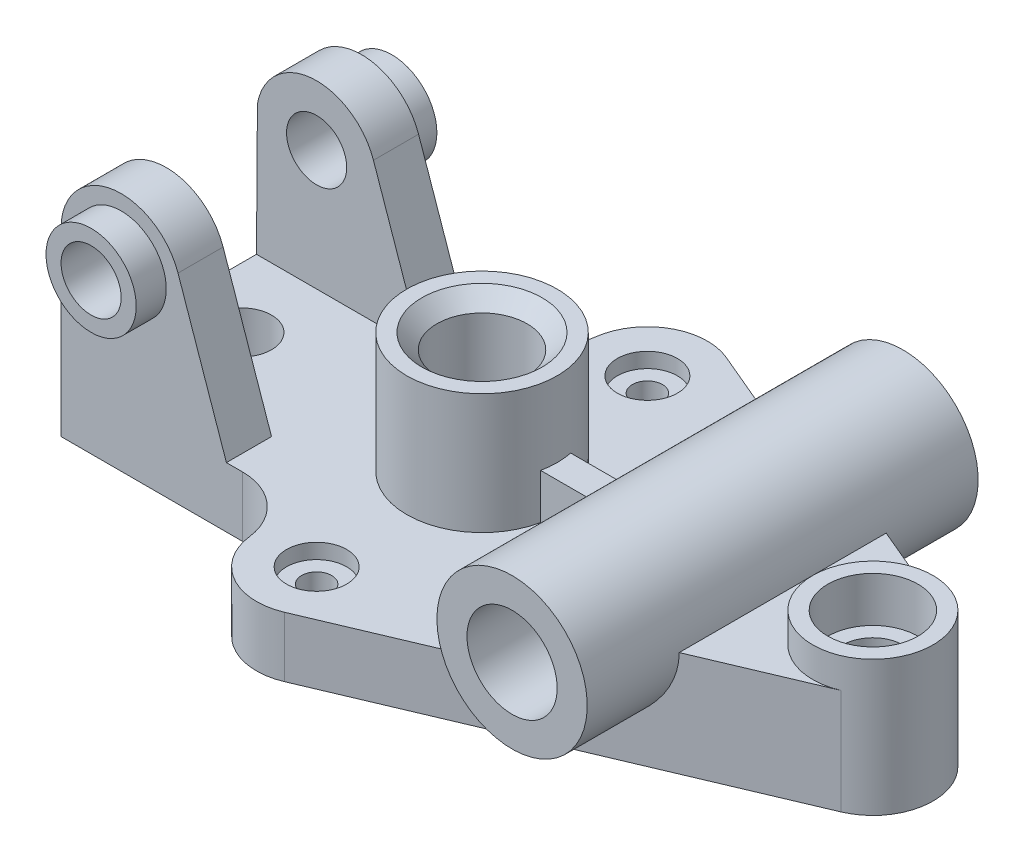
ISO-10303-21;
HEADER;
FILE_DESCRIPTION(('STEP AP214'),'2;1');
FILE_NAME('part.step','',(''),(''),'','','');
FILE_SCHEMA(('AUTOMOTIVE_DESIGN { 1 0 10303 214 1 1 1 1 }'));
ENDSEC;
DATA;
#1=APPLICATION_CONTEXT('core data for automotive mechanical design processes');
#2=APPLICATION_PROTOCOL_DEFINITION('international standard','automotive_design',2000,#1);
#3=PRODUCT_CONTEXT('',#1,'mechanical');
#4=PRODUCT('Part','Part','',(#3));
#5=PRODUCT_RELATED_PRODUCT_CATEGORY('part','',(#4));
#6=PRODUCT_DEFINITION_FORMATION('','',#4);
#7=PRODUCT_DEFINITION_CONTEXT('part definition',#1,'design');
#8=PRODUCT_DEFINITION('design','',#6,#7);
#9=PRODUCT_DEFINITION_SHAPE('','',#8);
#10=(LENGTH_UNIT() NAMED_UNIT(*) SI_UNIT(.MILLI.,.METRE.));
#11=(NAMED_UNIT(*) PLANE_ANGLE_UNIT() SI_UNIT($,.RADIAN.));
#12=(NAMED_UNIT(*) SI_UNIT($,.STERADIAN.) SOLID_ANGLE_UNIT());
#13=UNCERTAINTY_MEASURE_WITH_UNIT(LENGTH_MEASURE(1.E-05),#10,'distance_accuracy_value','');
#14=(GEOMETRIC_REPRESENTATION_CONTEXT(3) GLOBAL_UNCERTAINTY_ASSIGNED_CONTEXT((#13)) GLOBAL_UNIT_ASSIGNED_CONTEXT((#10,
#11,#12)) REPRESENTATION_CONTEXT('',''));
#15=CARTESIAN_POINT('',(0.,0.,0.));
#16=DIRECTION('',(0.,0.,1.));
#17=DIRECTION('',(1.,0.,0.));
#18=AXIS2_PLACEMENT_3D('',#15,#16,#17);
#19=CARTESIAN_POINT('',(22.7198818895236,-11.,71.6735980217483));
#20=DIRECTION('',(0.,1.,0.));
#21=DIRECTION('',(0.,0.,1.));
#22=AXIS2_PLACEMENT_3D('',#19,#20,#21);
#23=CYLINDRICAL_SURFACE('',#22,5.);
#24=CARTESIAN_POINT('',(22.7198818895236,0.,71.6735980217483));
#25=DIRECTION('',(0.,1.,0.));
#26=DIRECTION('',(0.,0.,1.));
#27=AXIS2_PLACEMENT_3D('',#24,#25,#26);
#28=CIRCLE('',#27,5.);
#29=CARTESIAN_POINT('',(22.7198818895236,0.,76.6735980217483));
#30=VERTEX_POINT('',#29);
#31=EDGE_CURVE('E581',#30,#30,#28,.F.);
#32=ORIENTED_EDGE('',*,*,#31,.T.);
#33=EDGE_LOOP('',(#32));
#34=FACE_BOUND('',#33,.T.);
#35=CARTESIAN_POINT('',(22.7198818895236,15.,71.6735980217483));
#36=DIRECTION('',(0.,1.,0.));
#37=DIRECTION('',(0.,0.,1.));
#38=AXIS2_PLACEMENT_3D('',#35,#36,#37);
#39=CIRCLE('',#38,5.);
#40=CARTESIAN_POINT('',(22.7198818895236,15.,76.6735980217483));
#41=VERTEX_POINT('',#40);
#42=EDGE_CURVE('E57',#41,#41,#39,.T.);
#43=ORIENTED_EDGE('',*,*,#42,.T.);
#44=EDGE_LOOP('',(#43));
#45=FACE_BOUND('',#44,.T.);
#46=ADVANCED_FACE('F53',(#34,#45),#23,.F.);
#47=CARTESIAN_POINT('',(22.7198818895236,-11.,-38.3264019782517));
#48=DIRECTION('',(0.,1.,0.));
#49=DIRECTION('',(0.,0.,1.));
#50=AXIS2_PLACEMENT_3D('',#47,#48,#49);
#51=CYLINDRICAL_SURFACE('',#50,5.);
#52=CARTESIAN_POINT('',(22.7198818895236,0.,-38.3264019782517));
#53=DIRECTION('',(0.,1.,0.));
#54=DIRECTION('',(0.,0.,1.));
#55=AXIS2_PLACEMENT_3D('',#52,#53,#54);
#56=CIRCLE('',#55,5.);
#57=CARTESIAN_POINT('',(22.7198818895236,0.,-33.3264019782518));
#58=VERTEX_POINT('',#57);
#59=EDGE_CURVE('E231',#58,#58,#56,.T.);
#60=ORIENTED_EDGE('',*,*,#59,.F.);
#61=EDGE_LOOP('',(#60));
#62=FACE_BOUND('',#61,.T.);
#63=CARTESIAN_POINT('',(22.7198818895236,15.,-38.3264019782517));
#64=DIRECTION('',(0.,1.,0.));
#65=DIRECTION('',(0.,0.,1.));
#66=AXIS2_PLACEMENT_3D('',#63,#64,#65);
#67=CIRCLE('',#66,5.);
#68=CARTESIAN_POINT('',(22.7198818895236,15.,-33.3264019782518));
#69=VERTEX_POINT('',#68);
#70=EDGE_CURVE('E577',#69,#69,#67,.F.);
#71=ORIENTED_EDGE('',*,*,#70,.F.);
#72=EDGE_LOOP('',(#71));
#73=FACE_BOUND('',#72,.T.);
#74=ADVANCED_FACE('F895',(#62,#73),#51,.F.);
#75=CARTESIAN_POINT('',(72.7198818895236,35.,0.));
#76=DIRECTION('',(1.,0.,0.));
#77=DIRECTION('',(0.,0.,-1.));
#78=AXIS2_PLACEMENT_3D('',#75,#76,#77);
#79=PLANE('',#78);
#80=DIRECTION('',(0.,1.,0.));
#81=VECTOR('',#80,1.);
#82=CARTESIAN_POINT('',(72.7198818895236,35.,21.6735980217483));
#83=LINE('',#82,#81);
#84=CARTESIAN_POINT('',(72.7198818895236,20.,21.6735980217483));
#85=VERTEX_POINT('',#84);
#86=CARTESIAN_POINT('',(72.7198818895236,35.,21.6735980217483));
#87=VERTEX_POINT('',#86);
#88=EDGE_CURVE('E228',#85,#87,#83,.T.);
#89=ORIENTED_EDGE('',*,*,#88,.F.);
#90=DIRECTION('',(0.,0.,1.));
#91=VECTOR('',#90,1.);
#92=CARTESIAN_POINT('',(72.7198818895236,20.,0.));
#93=LINE('',#92,#91);
#94=CARTESIAN_POINT('',(72.7198818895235,20.,72.2360506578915));
#95=VERTEX_POINT('',#94);
#96=EDGE_CURVE('E279',#85,#95,#93,.T.);
#97=ORIENTED_EDGE('',*,*,#96,.T.);
#98=DIRECTION('',(0.,-1.,0.));
#99=VECTOR('',#98,1.);
#100=CARTESIAN_POINT('',(72.7198818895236,35.,72.2360506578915));
#101=LINE('',#100,#99);
#102=CARTESIAN_POINT('',(72.7198818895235,35.,72.2360506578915));
#103=VERTEX_POINT('',#102);
#104=EDGE_CURVE('E295',#103,#95,#101,.T.);
#105=ORIENTED_EDGE('',*,*,#104,.F.);
#106=DIRECTION('',(0.,0.,1.));
#107=VECTOR('',#106,1.);
#108=CARTESIAN_POINT('',(72.7198818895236,35.,0.));
#109=LINE('',#108,#107);
#110=EDGE_CURVE('E283',#87,#103,#109,.T.);
#111=ORIENTED_EDGE('',*,*,#110,.F.);
#112=EDGE_LOOP('',(#89,#97,#105,#111));
#113=FACE_BOUND('',#112,.T.);
#114=ADVANCED_FACE('F867',(#113),#79,.F.);
#115=CARTESIAN_POINT('',(-16.9663877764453,20.,-43.3264019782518));
#116=DIRECTION('',(0.,1.,0.));
#117=DIRECTION('',(0.,0.,1.));
#118=AXIS2_PLACEMENT_3D('',#115,#116,#117);
#119=PLANE('',#118);
#120=CARTESIAN_POINT('',(22.7198818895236,20.,71.6735980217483));
#121=DIRECTION('',(0.,-1.,0.));
#122=DIRECTION('',(0.,0.,-1.));
#123=AXIS2_PLACEMENT_3D('',#120,#121,#122);
#124=CIRCLE('',#123,10.);
#125=CARTESIAN_POINT('',(22.7198818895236,20.,61.6735980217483));
#126=VERTEX_POINT('',#125);
#127=EDGE_CURVE('E599',#126,#126,#124,.T.);
#128=ORIENTED_EDGE('',*,*,#127,.T.);
#129=EDGE_LOOP('',(#128));
#130=FACE_BOUND('',#129,.T.);
#131=CARTESIAN_POINT('',(22.7198818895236,20.,-38.3264019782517));
#132=DIRECTION('',(0.,1.,0.));
#133=DIRECTION('',(0.,0.,1.));
#134=AXIS2_PLACEMENT_3D('',#131,#132,#133);
#135=CIRCLE('',#134,10.);
#136=CARTESIAN_POINT('',(22.7198818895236,20.,-28.3264019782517));
#137=VERTEX_POINT('',#136);
#138=EDGE_CURVE('E584',#137,#137,#135,.T.);
#139=ORIENTED_EDGE('',*,*,#138,.F.);
#140=EDGE_LOOP('',(#139));
#141=FACE_BOUND('',#140,.T.);
#142=CARTESIAN_POINT('',(-57.2801181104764,20.,16.6735980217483));
#143=DIRECTION('',(0.,1.,0.));
#144=DIRECTION('',(0.,0.,1.));
#145=AXIS2_PLACEMENT_3D('',#142,#143,#144);
#146=CIRCLE('',#145,10.);
#147=CARTESIAN_POINT('',(-57.2801181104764,20.,26.6735980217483));
#148=VERTEX_POINT('',#147);
#149=EDGE_CURVE('E455',#148,#148,#146,.T.);
#150=ORIENTED_EDGE('',*,*,#149,.F.);
#151=EDGE_LOOP('',(#150));
#152=FACE_BOUND('',#151,.T.);
#153=DIRECTION('',(-1.,0.,0.));
#154=VECTOR('',#153,1.);
#155=CARTESIAN_POINT('',(-16.9663877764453,20.,11.6735980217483));
#156=LINE('',#155,#154);
#157=CARTESIAN_POINT('',(72.7198818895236,20.,11.6735980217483));
#158=VERTEX_POINT('',#157);
#159=CARTESIAN_POINT('',(47.2147793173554,20.,11.6735980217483));
#160=VERTEX_POINT('',#159);
#161=EDGE_CURVE('E244',#158,#160,#156,.T.);
#162=ORIENTED_EDGE('',*,*,#161,.F.);
#163=CARTESIAN_POINT('',(72.7198818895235,20.,-38.888854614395));
#164=VERTEX_POINT('',#163);
#165=EDGE_CURVE('E284',#164,#158,#93,.T.);
#166=ORIENTED_EDGE('',*,*,#165,.F.);
#167=DIRECTION('',(-0.920967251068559,0.,-0.389639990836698));
#168=VECTOR('',#167,1.);
#169=CARTESIAN_POINT('',(30.5126817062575,20.,-56.7457469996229));
#170=LINE('',#169,#168);
#171=CARTESIAN_POINT('',(30.5126817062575,20.,-56.7457469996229));
#172=VERTEX_POINT('',#171);
#173=EDGE_CURVE('E485',#164,#172,#170,.T.);
#174=ORIENTED_EDGE('',*,*,#173,.T.);
#175=CARTESIAN_POINT('',(22.7198818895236,20.,-38.3264019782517));
#176=DIRECTION('',(0.,1.,0.));
#177=DIRECTION('',(0.,0.,-1.));
#178=AXIS2_PLACEMENT_3D('',#175,#176,#177);
#179=CIRCLE('',#178,20.);
#180=CARTESIAN_POINT('',(2.87674705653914,20.,-40.8264019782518));
#181=VERTEX_POINT('',#180);
#182=EDGE_CURVE('E488',#172,#181,#179,.T.);
#183=ORIENTED_EDGE('',*,*,#182,.T.);
#184=CARTESIAN_POINT('',(-16.9663877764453,20.,-43.3264019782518));
#185=DIRECTION('',(0.,-1.,0.));
#186=DIRECTION('',(0.,0.,1.));
#187=AXIS2_PLACEMENT_3D('',#184,#185,#186);
#188=CIRCLE('',#187,20.);
#189=CARTESIAN_POINT('',(-16.9663877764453,20.,-23.3264019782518));
#190=VERTEX_POINT('',#189);
#191=EDGE_CURVE('E491',#181,#190,#188,.T.);
#192=ORIENTED_EDGE('',*,*,#191,.T.);
#193=DIRECTION('',(-1.,0.,0.));
#194=VECTOR('',#193,1.);
#195=CARTESIAN_POINT('',(-77.2801181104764,20.,-23.3264019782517));
#196=LINE('',#195,#194);
#197=CARTESIAN_POINT('',(-22.2801181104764,20.,-23.3264019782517));
#198=VERTEX_POINT('',#197);
#199=EDGE_CURVE('E463',#190,#198,#196,.T.);
#200=ORIENTED_EDGE('',*,*,#199,.T.);
#201=DIRECTION('',(0.,0.,-1.));
#202=VECTOR('',#201,1.);
#203=CARTESIAN_POINT('',(-22.2801181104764,20.,-8.32640197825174));
#204=LINE('',#203,#202);
#205=CARTESIAN_POINT('',(-22.2801181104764,20.,-8.32640197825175));
#206=VERTEX_POINT('',#205);
#207=EDGE_CURVE('E398',#206,#198,#204,.T.);
#208=ORIENTED_EDGE('',*,*,#207,.F.);
#209=DIRECTION('',(-1.,0.,0.));
#210=VECTOR('',#209,1.);
#211=CARTESIAN_POINT('',(-77.2801181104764,20.,-8.32640197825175));
#212=LINE('',#211,#210);
#213=CARTESIAN_POINT('',(-77.2801181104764,20.,-8.32640197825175));
#214=VERTEX_POINT('',#213);
#215=EDGE_CURVE('E370',#206,#214,#212,.T.);
#216=ORIENTED_EDGE('',*,*,#215,.T.);
#217=DIRECTION('',(0.,0.,1.));
#218=VECTOR('',#217,1.);
#219=CARTESIAN_POINT('',(-77.2801181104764,20.,56.6735980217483));
#220=LINE('',#219,#218);
#221=CARTESIAN_POINT('',(-77.2801181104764,20.,41.6735980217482));
#222=VERTEX_POINT('',#221);
#223=EDGE_CURVE('E466',#214,#222,#220,.T.);
#224=ORIENTED_EDGE('',*,*,#223,.T.);
#225=DIRECTION('',(1.,0.,0.));
#226=VECTOR('',#225,1.);
#227=CARTESIAN_POINT('',(-77.2801181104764,20.,41.6735980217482));
#228=LINE('',#227,#226);
#229=CARTESIAN_POINT('',(-22.2801181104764,20.,41.6735980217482));
#230=VERTEX_POINT('',#229);
#231=EDGE_CURVE('E420',#222,#230,#228,.T.);
#232=ORIENTED_EDGE('',*,*,#231,.T.);
#233=DIRECTION('',(0.,0.,1.));
#234=VECTOR('',#233,1.);
#235=CARTESIAN_POINT('',(-22.2801181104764,20.,41.6735980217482));
#236=LINE('',#235,#234);
#237=CARTESIAN_POINT('',(-22.2801181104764,20.,56.6735980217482));
#238=VERTEX_POINT('',#237);
#239=EDGE_CURVE('E437',#230,#238,#236,.T.);
#240=ORIENTED_EDGE('',*,*,#239,.T.);
#241=DIRECTION('',(1.,0.,0.));
#242=VECTOR('',#241,1.);
#243=CARTESIAN_POINT('',(-77.2801181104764,20.,56.6735980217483));
#244=LINE('',#243,#242);
#245=CARTESIAN_POINT('',(-16.9663877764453,20.,56.6735980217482));
#246=VERTEX_POINT('',#245);
#247=EDGE_CURVE('E472',#238,#246,#244,.T.);
#248=ORIENTED_EDGE('',*,*,#247,.T.);
#249=CARTESIAN_POINT('',(-16.9663877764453,20.,76.6735980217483));
#250=DIRECTION('',(0.,-1.,0.));
#251=DIRECTION('',(0.,0.,-1.));
#252=AXIS2_PLACEMENT_3D('',#249,#250,#251);
#253=CIRCLE('',#252,20.);
#254=CARTESIAN_POINT('',(2.87674705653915,20.,74.1735980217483));
#255=VERTEX_POINT('',#254);
#256=EDGE_CURVE('E475',#246,#255,#253,.T.);
#257=ORIENTED_EDGE('',*,*,#256,.T.);
#258=CARTESIAN_POINT('',(22.7198818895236,20.,71.6735980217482));
#259=DIRECTION('',(0.,1.,0.));
#260=DIRECTION('',(0.,0.,1.));
#261=AXIS2_PLACEMENT_3D('',#258,#259,#260);
#262=CIRCLE('',#261,20.);
#263=CARTESIAN_POINT('',(30.5126817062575,20.,90.0929430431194));
#264=VERTEX_POINT('',#263);
#265=EDGE_CURVE('E478',#255,#264,#262,.T.);
#266=ORIENTED_EDGE('',*,*,#265,.T.);
#267=DIRECTION('',(0.920967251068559,0.,-0.389639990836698));
#268=VECTOR('',#267,1.);
#269=CARTESIAN_POINT('',(30.5126817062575,20.,90.0929430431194));
#270=LINE('',#269,#268);
#271=EDGE_CURVE('E481',#264,#95,#270,.T.);
#272=ORIENTED_EDGE('',*,*,#271,.T.);
#273=ORIENTED_EDGE('',*,*,#96,.F.);
#274=DIRECTION('',(-1.,0.,0.));
#275=VECTOR('',#274,1.);
#276=CARTESIAN_POINT('',(-16.9663877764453,20.,21.6735980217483));
#277=LINE('',#276,#275);
#278=CARTESIAN_POINT('',(47.2147793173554,20.,21.6735980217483));
#279=VERTEX_POINT('',#278);
#280=EDGE_CURVE('E238',#85,#279,#277,.T.);
#281=ORIENTED_EDGE('',*,*,#280,.T.);
#282=CARTESIAN_POINT('',(22.7198818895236,20.,16.6735980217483));
#283=DIRECTION('',(0.,1.,0.));
#284=DIRECTION('',(0.,0.,1.));
#285=AXIS2_PLACEMENT_3D('',#282,#283,#284);
#286=CIRCLE('',#285,25.);
#287=EDGE_CURVE('E63',#160,#279,#286,.T.);
#288=ORIENTED_EDGE('',*,*,#287,.F.);
#289=EDGE_LOOP('',(#162,#166,#174,#183,#192,#200,#208,#216,#224,#232,#240,#248,#257,#266,#272,
#273,#281,#288));
#290=FACE_BOUND('',#289,.T.);
#291=ADVANCED_FACE('F829',(#130,#141,#152,#290),#119,.T.);
#292=CARTESIAN_POINT('',(152.719881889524,20.,16.6735980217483));
#293=DIRECTION('',(0.,-1.,0.));
#294=DIRECTION('',(0.,0.,-1.));
#295=AXIS2_PLACEMENT_3D('',#292,#293,#294);
#296=CYLINDRICAL_SURFACE('',#295,20.);
#297=CARTESIAN_POINT('',(152.719881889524,0.,16.6735980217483));
#298=DIRECTION('',(0.,1.,0.));
#299=DIRECTION('',(0.,0.,1.));
#300=AXIS2_PLACEMENT_3D('',#297,#298,#299);
#301=CIRCLE('',#300,20.);
#302=CARTESIAN_POINT('',(160.512681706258,0.,35.0929430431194));
#303=VERTEX_POINT('',#302);
#304=CARTESIAN_POINT('',(160.512681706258,0.,-1.74574699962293));
#305=VERTEX_POINT('',#304);
#306=EDGE_CURVE('E514',#303,#305,#301,.T.);
#307=ORIENTED_EDGE('',*,*,#306,.T.);
#308=DIRECTION('',(0.,-1.,0.));
#309=VECTOR('',#308,1.);
#310=CARTESIAN_POINT('',(160.512681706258,20.,-1.74574699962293));
#311=LINE('',#310,#309);
#312=CARTESIAN_POINT('',(160.512681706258,35.,-1.74574699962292));
#313=VERTEX_POINT('',#312);
#314=EDGE_CURVE('E536',#313,#305,#311,.T.);
#315=ORIENTED_EDGE('',*,*,#314,.F.);
#316=CARTESIAN_POINT('',(152.719881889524,35.,16.6735980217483));
#317=DIRECTION('',(0.,1.,0.));
#318=DIRECTION('',(0.,0.,1.));
#319=AXIS2_PLACEMENT_3D('',#316,#317,#318);
#320=CIRCLE('',#319,20.);
#321=CARTESIAN_POINT('',(160.512681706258,35.,35.0929430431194));
#322=VERTEX_POINT('',#321);
#323=EDGE_CURVE('E292',#322,#313,#320,.F.);
#324=ORIENTED_EDGE('',*,*,#323,.F.);
#325=DIRECTION('',(0.,-1.,0.));
#326=VECTOR('',#325,1.);
#327=CARTESIAN_POINT('',(160.512681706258,20.,35.0929430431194));
#328=LINE('',#327,#326);
#329=EDGE_CURVE('E540',#322,#303,#328,.T.);
#330=ORIENTED_EDGE('',*,*,#329,.T.);
#331=EDGE_LOOP('',(#307,#315,#324,#330));
#332=FACE_BOUND('',#331,.T.);
#333=CARTESIAN_POINT('',(152.719881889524,45.,16.6735980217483));
#334=DIRECTION('',(0.,1.,0.));
#335=DIRECTION('',(0.,0.,1.));
#336=AXIS2_PLACEMENT_3D('',#333,#334,#335);
#337=CIRCLE('',#336,20.);
#338=CARTESIAN_POINT('',(152.719881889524,45.,36.6735980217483));
#339=VERTEX_POINT('',#338);
#340=EDGE_CURVE('E325',#339,#339,#337,.T.);
#341=ORIENTED_EDGE('',*,*,#340,.F.);
#342=EDGE_LOOP('',(#341));
#343=FACE_BOUND('',#342,.T.);
#344=ADVANCED_FACE('F921',(#332,#343),#296,.T.);
#345=CARTESIAN_POINT('',(-77.2801181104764,20.,56.6735980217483));
#346=DIRECTION('',(0.,0.,-1.));
#347=DIRECTION('',(-1.,0.,0.));
#348=AXIS2_PLACEMENT_3D('',#345,#346,#347);
#349=PLANE('',#348);
#350=DIRECTION('',(1.,0.,0.));
#351=VECTOR('',#350,1.);
#352=CARTESIAN_POINT('',(-77.2801181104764,0.,56.6735980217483));
#353=LINE('',#352,#351);
#354=CARTESIAN_POINT('',(-77.2801181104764,0.,56.6735980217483));
#355=VERTEX_POINT('',#354);
#356=CARTESIAN_POINT('',(-16.9663877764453,0.,56.6735980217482));
#357=VERTEX_POINT('',#356);
#358=EDGE_CURVE('E501',#355,#357,#353,.T.);
#359=ORIENTED_EDGE('',*,*,#358,.T.);
#360=DIRECTION('',(0.,-1.,0.));
#361=VECTOR('',#360,1.);
#362=CARTESIAN_POINT('',(-16.9663877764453,20.,56.6735980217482));
#363=LINE('',#362,#361);
#364=EDGE_CURVE('E552',#246,#357,#363,.T.);
#365=ORIENTED_EDGE('',*,*,#364,.F.);
#366=ORIENTED_EDGE('',*,*,#247,.F.);
#367=DIRECTION('',(-0.326920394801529,0.945051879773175,0.));
#368=VECTOR('',#367,1.);
#369=CARTESIAN_POINT('',(-38.3790805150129,66.5384078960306,56.6735980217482));
#370=LINE('',#369,#368);
#371=CARTESIAN_POINT('',(-38.3790805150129,66.5384078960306,56.6735980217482));
#372=VERTEX_POINT('',#371);
#373=EDGE_CURVE('E419',#238,#372,#370,.T.);
#374=ORIENTED_EDGE('',*,*,#373,.T.);
#375=CARTESIAN_POINT('',(-57.2801181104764,60.,56.6735980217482));
#376=DIRECTION('',(0.,0.,1.));
#377=DIRECTION('',(-1.,0.,0.));
#378=AXIS2_PLACEMENT_3D('',#375,#376,#377);
#379=CIRCLE('',#378,20.);
#380=CARTESIAN_POINT('',(-77.2801181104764,60.,56.6735980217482));
#381=VERTEX_POINT('',#380);
#382=EDGE_CURVE('E425',#372,#381,#379,.T.);
#383=ORIENTED_EDGE('',*,*,#382,.T.);
#384=DIRECTION('',(0.,-1.,0.));
#385=VECTOR('',#384,1.);
#386=CARTESIAN_POINT('',(-77.2801181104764,20.,56.6735980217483));
#387=LINE('',#386,#385);
#388=EDGE_CURVE('E556',#381,#355,#387,.T.);
#389=ORIENTED_EDGE('',*,*,#388,.T.);
#390=EDGE_LOOP('',(#359,#365,#366,#374,#383,#389));
#391=FACE_BOUND('',#390,.T.);
#392=CARTESIAN_POINT('',(-57.2801181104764,60.,56.6735980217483));
#393=DIRECTION('',(0.,0.,-1.));
#394=DIRECTION('',(-1.,0.,0.));
#395=AXIS2_PLACEMENT_3D('',#392,#393,#394);
#396=CIRCLE('',#395,15.);
#397=CARTESIAN_POINT('',(-72.2801181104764,60.,56.6735980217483));
#398=VERTEX_POINT('',#397);
#399=EDGE_CURVE('E564',#398,#398,#396,.F.);
#400=ORIENTED_EDGE('',*,*,#399,.F.);
#401=EDGE_LOOP('',(#400));
#402=FACE_BOUND('',#401,.T.);
#403=ADVANCED_FACE('F846',(#391,#402),#349,.F.);
#404=CARTESIAN_POINT('',(-16.9663877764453,0.,-43.3264019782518));
#405=DIRECTION('',(0.,1.,0.));
#406=DIRECTION('',(0.,0.,1.));
#407=AXIS2_PLACEMENT_3D('',#404,#405,#406);
#408=PLANE('',#407);
#409=ORIENTED_EDGE('',*,*,#31,.F.);
#410=EDGE_LOOP('',(#409));
#411=FACE_BOUND('',#410,.T.);
#412=ORIENTED_EDGE('',*,*,#59,.T.);
#413=EDGE_LOOP('',(#412));
#414=FACE_BOUND('',#413,.T.);
#415=CARTESIAN_POINT('',(22.7198818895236,0.,16.6735980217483));
#416=DIRECTION('',(0.,1.,0.));
#417=DIRECTION('',(0.,0.,1.));
#418=AXIS2_PLACEMENT_3D('',#415,#416,#417);
#419=CIRCLE('',#418,25.);
#420=CARTESIAN_POINT('',(22.7198818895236,0.,41.6735980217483));
#421=VERTEX_POINT('',#420);
#422=EDGE_CURVE('E353',#421,#421,#419,.T.);
#423=ORIENTED_EDGE('',*,*,#422,.T.);
#424=EDGE_LOOP('',(#423));
#425=FACE_BOUND('',#424,.T.);
#426=CARTESIAN_POINT('',(-57.2801181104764,0.,16.6735980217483));
#427=DIRECTION('',(0.,1.,0.));
#428=DIRECTION('',(0.,0.,1.));
#429=AXIS2_PLACEMENT_3D('',#426,#427,#428);
#430=CIRCLE('',#429,10.);
#431=CARTESIAN_POINT('',(-57.2801181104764,0.,26.6735980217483));
#432=VERTEX_POINT('',#431);
#433=EDGE_CURVE('E448',#432,#432,#430,.T.);
#434=ORIENTED_EDGE('',*,*,#433,.T.);
#435=EDGE_LOOP('',(#434));
#436=FACE_BOUND('',#435,.T.);
#437=CARTESIAN_POINT('',(152.719881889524,0.,16.6735980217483));
#438=DIRECTION('',(0.,1.,0.));
#439=DIRECTION('',(0.,0.,1.));
#440=AXIS2_PLACEMENT_3D('',#437,#438,#439);
#441=CIRCLE('',#440,20.);
#442=EDGE_CURVE('E306',#305,#303,#441,.T.);
#443=ORIENTED_EDGE('',*,*,#442,.T.);
#444=DIRECTION('',(0.920967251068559,0.,-0.389639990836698));
#445=VECTOR('',#444,1.);
#446=CARTESIAN_POINT('',(30.5126817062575,0.,90.0929430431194));
#447=LINE('',#446,#445);
#448=CARTESIAN_POINT('',(30.5126817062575,0.,90.0929430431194));
#449=VERTEX_POINT('',#448);
#450=EDGE_CURVE('E510',#449,#303,#447,.T.);
#451=ORIENTED_EDGE('',*,*,#450,.F.);
#452=CARTESIAN_POINT('',(22.7198818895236,0.,71.6735980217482));
#453=DIRECTION('',(0.,1.,0.));
#454=DIRECTION('',(0.,0.,1.));
#455=AXIS2_PLACEMENT_3D('',#452,#453,#454);
#456=CIRCLE('',#455,20.);
#457=CARTESIAN_POINT('',(2.87674705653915,0.,74.1735980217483));
#458=VERTEX_POINT('',#457);
#459=EDGE_CURVE('E507',#458,#449,#456,.T.);
#460=ORIENTED_EDGE('',*,*,#459,.F.);
#461=CARTESIAN_POINT('',(-16.9663877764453,0.,76.6735980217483));
#462=DIRECTION('',(0.,-1.,0.));
#463=DIRECTION('',(0.,0.,-1.));
#464=AXIS2_PLACEMENT_3D('',#461,#462,#463);
#465=CIRCLE('',#464,20.);
#466=EDGE_CURVE('E504',#357,#458,#465,.T.);
#467=ORIENTED_EDGE('',*,*,#466,.F.);
#468=ORIENTED_EDGE('',*,*,#358,.F.);
#469=DIRECTION('',(0.,0.,1.));
#470=VECTOR('',#469,1.);
#471=CARTESIAN_POINT('',(-77.2801181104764,0.,56.6735980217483));
#472=LINE('',#471,#470);
#473=CARTESIAN_POINT('',(-77.2801181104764,0.,-23.3264019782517));
#474=VERTEX_POINT('',#473);
#475=EDGE_CURVE('E498',#474,#355,#472,.T.);
#476=ORIENTED_EDGE('',*,*,#475,.F.);
#477=DIRECTION('',(-1.,0.,0.));
#478=VECTOR('',#477,1.);
#479=CARTESIAN_POINT('',(-77.2801181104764,0.,-23.3264019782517));
#480=LINE('',#479,#478);
#481=CARTESIAN_POINT('',(-16.9663877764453,0.,-23.3264019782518));
#482=VERTEX_POINT('',#481);
#483=EDGE_CURVE('E459',#482,#474,#480,.T.);
#484=ORIENTED_EDGE('',*,*,#483,.F.);
#485=CARTESIAN_POINT('',(-16.9663877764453,0.,-43.3264019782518));
#486=DIRECTION('',(0.,-1.,0.));
#487=DIRECTION('',(0.,0.,1.));
#488=AXIS2_PLACEMENT_3D('',#485,#486,#487);
#489=CIRCLE('',#488,20.);
#490=CARTESIAN_POINT('',(2.87674705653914,0.,-40.8264019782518));
#491=VERTEX_POINT('',#490);
#492=EDGE_CURVE('E467',#491,#482,#489,.T.);
#493=ORIENTED_EDGE('',*,*,#492,.F.);
#494=CARTESIAN_POINT('',(22.7198818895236,0.,-38.3264019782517));
#495=DIRECTION('',(0.,1.,0.));
#496=DIRECTION('',(0.,0.,-1.));
#497=AXIS2_PLACEMENT_3D('',#494,#495,#496);
#498=CIRCLE('',#497,20.);
#499=CARTESIAN_POINT('',(30.5126817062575,0.,-56.7457469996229));
#500=VERTEX_POINT('',#499);
#501=EDGE_CURVE('E520',#500,#491,#498,.T.);
#502=ORIENTED_EDGE('',*,*,#501,.F.);
#503=DIRECTION('',(-0.920967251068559,0.,-0.389639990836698));
#504=VECTOR('',#503,1.);
#505=CARTESIAN_POINT('',(30.5126817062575,0.,-56.7457469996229));
#506=LINE('',#505,#504);
#507=EDGE_CURVE('E517',#305,#500,#506,.T.);
#508=ORIENTED_EDGE('',*,*,#507,.F.);
#509=EDGE_LOOP('',(#443,#451,#460,#467,#468,#476,#484,#493,#502,#508));
#510=FACE_BOUND('',#509,.T.);
#511=ADVANCED_FACE('F942',(#411,#414,#425,#436,#510),#408,.F.);
#512=CARTESIAN_POINT('',(-77.2801181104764,20.,-23.3264019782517));
#513=DIRECTION('',(0.,0.,1.));
#514=DIRECTION('',(1.,0.,0.));
#515=AXIS2_PLACEMENT_3D('',#512,#513,#514);
#516=PLANE('',#515);
#517=CARTESIAN_POINT('',(-57.2801181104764,60.,-23.3264019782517));
#518=DIRECTION('',(0.,0.,1.));
#519=DIRECTION('',(1.,0.,0.));
#520=AXIS2_PLACEMENT_3D('',#517,#518,#519);
#521=CIRCLE('',#520,15.);
#522=CARTESIAN_POINT('',(-42.2801181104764,60.,-23.3264019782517));
#523=VERTEX_POINT('',#522);
#524=EDGE_CURVE('E356',#523,#523,#521,.F.);
#525=ORIENTED_EDGE('',*,*,#524,.F.);
#526=EDGE_LOOP('',(#525));
#527=FACE_BOUND('',#526,.T.);
#528=ORIENTED_EDGE('',*,*,#483,.T.);
#529=DIRECTION('',(0.,-1.,0.));
#530=VECTOR('',#529,1.);
#531=CARTESIAN_POINT('',(-77.2801181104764,20.,-23.3264019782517));
#532=LINE('',#531,#530);
#533=CARTESIAN_POINT('',(-77.2801181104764,20.,-23.3264019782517));
#534=VERTEX_POINT('',#533);
#535=EDGE_CURVE('E560',#534,#474,#532,.T.);
#536=ORIENTED_EDGE('',*,*,#535,.F.);
#537=DIRECTION('',(0.0071500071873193,0.999974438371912,0.));
#538=VECTOR('',#537,1.);
#539=CARTESIAN_POINT('',(-76.9689843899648,63.5140496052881,-23.3264019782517));
#540=LINE('',#539,#538);
#541=CARTESIAN_POINT('',(-76.9689843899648,63.5140496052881,-23.3264019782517));
#542=VERTEX_POINT('',#541);
#543=EDGE_CURVE('E369',#534,#542,#540,.T.);
#544=ORIENTED_EDGE('',*,*,#543,.T.);
#545=CARTESIAN_POINT('',(-57.2801181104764,60.,-23.3264019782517));
#546=DIRECTION('',(0.,0.,-1.));
#547=DIRECTION('',(1.,0.,0.));
#548=AXIS2_PLACEMENT_3D('',#545,#546,#547);
#549=CIRCLE('',#548,20.);
#550=CARTESIAN_POINT('',(-38.3790805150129,66.5384078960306,-23.3264019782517));
#551=VERTEX_POINT('',#550);
#552=EDGE_CURVE('E391',#542,#551,#549,.T.);
#553=ORIENTED_EDGE('',*,*,#552,.T.);
#554=DIRECTION('',(0.326920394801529,-0.945051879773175,0.));
#555=VECTOR('',#554,1.);
#556=CARTESIAN_POINT('',(-22.2801181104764,20.,-23.3264019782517));
#557=LINE('',#556,#555);
#558=EDGE_CURVE('E375',#551,#198,#557,.T.);
#559=ORIENTED_EDGE('',*,*,#558,.T.);
#560=ORIENTED_EDGE('',*,*,#199,.F.);
#561=DIRECTION('',(0.,-1.,0.));
#562=VECTOR('',#561,1.);
#563=CARTESIAN_POINT('',(-16.9663877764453,20.,-23.3264019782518));
#564=LINE('',#563,#562);
#565=EDGE_CURVE('E494',#190,#482,#564,.T.);
#566=ORIENTED_EDGE('',*,*,#565,.T.);
#567=EDGE_LOOP('',(#528,#536,#544,#553,#559,#560,#566));
#568=FACE_BOUND('',#567,.T.);
#569=ADVANCED_FACE('F55',(#527,#568),#516,.F.);
#570=CARTESIAN_POINT('',(-77.2801181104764,20.,56.6735980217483));
#571=DIRECTION('',(1.,0.,0.));
#572=DIRECTION('',(0.,0.,-1.));
#573=AXIS2_PLACEMENT_3D('',#570,#571,#572);
#574=PLANE('',#573);
#575=ORIENTED_EDGE('',*,*,#475,.T.);
#576=ORIENTED_EDGE('',*,*,#388,.F.);
#577=DIRECTION('',(0.,0.,1.));
#578=VECTOR('',#577,1.);
#579=CARTESIAN_POINT('',(-77.2801181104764,60.,41.6735980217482));
#580=LINE('',#579,#578);
#581=CARTESIAN_POINT('',(-77.2801181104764,60.,41.6735980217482));
#582=VERTEX_POINT('',#581);
#583=EDGE_CURVE('E444',#582,#381,#580,.T.);
#584=ORIENTED_EDGE('',*,*,#583,.F.);
#585=DIRECTION('',(0.,-1.,0.));
#586=VECTOR('',#585,1.);
#587=CARTESIAN_POINT('',(-77.2801181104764,20.,41.6735980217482));
#588=LINE('',#587,#586);
#589=EDGE_CURVE('E433',#582,#222,#588,.T.);
#590=ORIENTED_EDGE('',*,*,#589,.T.);
#591=ORIENTED_EDGE('',*,*,#223,.F.);
#592=EDGE_CURVE('E468',#534,#214,#220,.T.);
#593=ORIENTED_EDGE('',*,*,#592,.F.);
#594=ORIENTED_EDGE('',*,*,#535,.T.);
#595=EDGE_LOOP('',(#575,#576,#584,#590,#591,#593,#594));
#596=FACE_BOUND('',#595,.T.);
#597=ADVANCED_FACE('F837',(#596),#574,.F.);
#598=CARTESIAN_POINT('',(-16.9663877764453,20.,76.6735980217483));
#599=DIRECTION('',(0.,-1.,0.));
#600=DIRECTION('',(0.,0.,-1.));
#601=AXIS2_PLACEMENT_3D('',#598,#599,#600);
#602=CYLINDRICAL_SURFACE('',#601,20.);
#603=ORIENTED_EDGE('',*,*,#466,.T.);
#604=DIRECTION('',(0.,-1.,0.));
#605=VECTOR('',#604,1.);
#606=CARTESIAN_POINT('',(2.87674705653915,20.,74.1735980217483));
#607=LINE('',#606,#605);
#608=EDGE_CURVE('E548',#255,#458,#607,.T.);
#609=ORIENTED_EDGE('',*,*,#608,.F.);
#610=ORIENTED_EDGE('',*,*,#256,.F.);
#611=ORIENTED_EDGE('',*,*,#364,.T.);
#612=EDGE_LOOP('',(#603,#609,#610,#611));
#613=FACE_BOUND('',#612,.T.);
#614=ADVANCED_FACE('F853',(#613),#602,.F.);
#615=CARTESIAN_POINT('',(22.7198818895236,20.,71.6735980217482));
#616=DIRECTION('',(0.,-1.,0.));
#617=DIRECTION('',(0.,0.,-1.));
#618=AXIS2_PLACEMENT_3D('',#615,#616,#617);
#619=CYLINDRICAL_SURFACE('',#618,20.);
#620=ORIENTED_EDGE('',*,*,#459,.T.);
#621=DIRECTION('',(0.,-1.,0.));
#622=VECTOR('',#621,1.);
#623=CARTESIAN_POINT('',(30.5126817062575,20.,90.0929430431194));
#624=LINE('',#623,#622);
#625=EDGE_CURVE('E544',#264,#449,#624,.T.);
#626=ORIENTED_EDGE('',*,*,#625,.F.);
#627=ORIENTED_EDGE('',*,*,#265,.F.);
#628=ORIENTED_EDGE('',*,*,#608,.T.);
#629=EDGE_LOOP('',(#620,#626,#627,#628));
#630=FACE_BOUND('',#629,.T.);
#631=ADVANCED_FACE('F859',(#630),#619,.T.);
#632=CARTESIAN_POINT('',(30.5126817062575,20.,90.0929430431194));
#633=DIRECTION('',(-0.389639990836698,0.,-0.920967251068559));
#634=DIRECTION('',(-0.920967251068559,0.,0.389639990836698));
#635=AXIS2_PLACEMENT_3D('',#632,#633,#634);
#636=PLANE('',#635);
#637=DIRECTION('',(0.920967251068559,0.,-0.389639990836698));
#638=VECTOR('',#637,1.);
#639=CARTESIAN_POINT('',(36.9618772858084,35.,87.3644372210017));
#640=LINE('',#639,#638);
#641=CARTESIAN_POINT('',(122.719881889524,35.,51.0822045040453));
#642=VERTEX_POINT('',#641);
#643=EDGE_CURVE('E289',#642,#322,#640,.T.);
#644=ORIENTED_EDGE('',*,*,#643,.F.);
#645=CARTESIAN_POINT('',(97.7198818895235,35.,61.6591275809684));
#646=DIRECTION('',(-0.389639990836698,0.,-0.920967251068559));
#647=DIRECTION('',(0.920967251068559,0.,-0.389639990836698));
#648=AXIS2_PLACEMENT_3D('',#645,#646,#647);
#649=ELLIPSE('',#648,27.1453734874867,25.);
#650=EDGE_CURVE('E275',#642,#103,#649,.T.);
#651=ORIENTED_EDGE('',*,*,#650,.T.);
#652=ORIENTED_EDGE('',*,*,#104,.T.);
#653=ORIENTED_EDGE('',*,*,#271,.F.);
#654=ORIENTED_EDGE('',*,*,#625,.T.);
#655=ORIENTED_EDGE('',*,*,#450,.T.);
#656=ORIENTED_EDGE('',*,*,#329,.F.);
#657=EDGE_LOOP('',(#644,#651,#652,#653,#654,#655,#656));
#658=FACE_BOUND('',#657,.T.);
#659=ADVANCED_FACE('F863',(#658),#636,.F.);
#660=CARTESIAN_POINT('',(30.5126817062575,20.,-56.7457469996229));
#661=DIRECTION('',(-0.389639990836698,0.,0.920967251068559));
#662=DIRECTION('',(0.920967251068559,0.,0.389639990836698));
#663=AXIS2_PLACEMENT_3D('',#660,#661,#662);
#664=PLANE('',#663);
#665=DIRECTION('',(0.,-1.,0.));
#666=VECTOR('',#665,1.);
#667=CARTESIAN_POINT('',(72.7198818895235,35.,-38.888854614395));
#668=LINE('',#667,#666);
#669=CARTESIAN_POINT('',(72.7198818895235,35.,-38.888854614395));
#670=VERTEX_POINT('',#669);
#671=EDGE_CURVE('E302',#670,#164,#668,.T.);
#672=ORIENTED_EDGE('',*,*,#671,.F.);
#673=CARTESIAN_POINT('',(97.7198818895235,35.,-28.3119315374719));
#674=DIRECTION('',(-0.389639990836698,0.,0.920967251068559));
#675=DIRECTION('',(-0.920967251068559,0.,-0.389639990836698));
#676=AXIS2_PLACEMENT_3D('',#673,#674,#675);
#677=ELLIPSE('',#676,27.1453734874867,25.);
#678=CARTESIAN_POINT('',(122.719881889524,35.,-17.7350084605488));
#679=VERTEX_POINT('',#678);
#680=EDGE_CURVE('E271',#670,#679,#677,.T.);
#681=ORIENTED_EDGE('',*,*,#680,.T.);
#682=DIRECTION('',(-0.920967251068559,0.,-0.389639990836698));
#683=VECTOR('',#682,1.);
#684=CARTESIAN_POINT('',(24.9953803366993,35.,-59.0799898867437));
#685=LINE('',#684,#683);
#686=EDGE_CURVE('E280',#313,#679,#685,.T.);
#687=ORIENTED_EDGE('',*,*,#686,.F.);
#688=ORIENTED_EDGE('',*,*,#314,.T.);
#689=ORIENTED_EDGE('',*,*,#507,.T.);
#690=DIRECTION('',(0.,-1.,0.));
#691=VECTOR('',#690,1.);
#692=CARTESIAN_POINT('',(30.5126817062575,20.,-56.7457469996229));
#693=LINE('',#692,#691);
#694=EDGE_CURVE('E532',#172,#500,#693,.T.);
#695=ORIENTED_EDGE('',*,*,#694,.F.);
#696=ORIENTED_EDGE('',*,*,#173,.F.);
#697=EDGE_LOOP('',(#672,#681,#687,#688,#689,#695,#696));
#698=FACE_BOUND('',#697,.T.);
#699=ADVANCED_FACE('F876',(#698),#664,.F.);
#700=CARTESIAN_POINT('',(22.7198818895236,20.,-38.3264019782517));
#701=DIRECTION('',(0.,-1.,0.));
#702=DIRECTION('',(0.,0.,-1.));
#703=AXIS2_PLACEMENT_3D('',#700,#701,#702);
#704=CYLINDRICAL_SURFACE('',#703,20.);
#705=ORIENTED_EDGE('',*,*,#501,.T.);
#706=DIRECTION('',(0.,-1.,0.));
#707=VECTOR('',#706,1.);
#708=CARTESIAN_POINT('',(2.87674705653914,20.,-40.8264019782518));
#709=LINE('',#708,#707);
#710=EDGE_CURVE('E528',#181,#491,#709,.T.);
#711=ORIENTED_EDGE('',*,*,#710,.F.);
#712=ORIENTED_EDGE('',*,*,#182,.F.);
#713=ORIENTED_EDGE('',*,*,#694,.T.);
#714=EDGE_LOOP('',(#705,#711,#712,#713));
#715=FACE_BOUND('',#714,.T.);
#716=ADVANCED_FACE('F936',(#715),#704,.T.);
#717=CARTESIAN_POINT('',(-16.9663877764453,20.,-43.3264019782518));
#718=DIRECTION('',(0.,-1.,0.));
#719=DIRECTION('',(0.,0.,-1.));
#720=AXIS2_PLACEMENT_3D('',#717,#718,#719);
#721=CYLINDRICAL_SURFACE('',#720,20.);
#722=ORIENTED_EDGE('',*,*,#492,.T.);
#723=ORIENTED_EDGE('',*,*,#565,.F.);
#724=ORIENTED_EDGE('',*,*,#191,.F.);
#725=ORIENTED_EDGE('',*,*,#710,.T.);
#726=EDGE_LOOP('',(#722,#723,#724,#725));
#727=FACE_BOUND('',#726,.T.);
#728=ADVANCED_FACE('F928',(#727),#721,.F.);
#729=CARTESIAN_POINT('',(-57.2801181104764,20.,16.6735980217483));
#730=DIRECTION('',(0.,-1.,0.));
#731=DIRECTION('',(0.,0.,-1.));
#732=AXIS2_PLACEMENT_3D('',#729,#730,#731);
#733=CYLINDRICAL_SURFACE('',#732,10.);
#734=ORIENTED_EDGE('',*,*,#433,.F.);
#735=EDGE_LOOP('',(#734));
#736=FACE_BOUND('',#735,.T.);
#737=ORIENTED_EDGE('',*,*,#149,.T.);
#738=EDGE_LOOP('',(#737));
#739=FACE_BOUND('',#738,.T.);
#740=ADVANCED_FACE('F926',(#736,#739),#733,.F.);
#741=CARTESIAN_POINT('',(-57.2801181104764,60.,41.6735980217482));
#742=DIRECTION('',(0.,0.,1.));
#743=DIRECTION('',(1.,0.,0.));
#744=AXIS2_PLACEMENT_3D('',#741,#742,#743);
#745=CYLINDRICAL_SURFACE('',#744,20.);
#746=ORIENTED_EDGE('',*,*,#382,.F.);
#747=DIRECTION('',(0.,0.,1.));
#748=VECTOR('',#747,1.);
#749=CARTESIAN_POINT('',(-38.3790805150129,66.5384078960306,41.6735980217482));
#750=LINE('',#749,#748);
#751=CARTESIAN_POINT('',(-38.3790805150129,66.5384078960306,41.6735980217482));
#752=VERTEX_POINT('',#751);
#753=EDGE_CURVE('E449',#752,#372,#750,.T.);
#754=ORIENTED_EDGE('',*,*,#753,.F.);
#755=CARTESIAN_POINT('',(-57.2801181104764,60.,41.6735980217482));
#756=DIRECTION('',(0.,0.,1.));
#757=DIRECTION('',(-1.,0.,0.));
#758=AXIS2_PLACEMENT_3D('',#755,#756,#757);
#759=CIRCLE('',#758,20.);
#760=EDGE_CURVE('E429',#752,#582,#759,.T.);
#761=ORIENTED_EDGE('',*,*,#760,.T.);
#762=ORIENTED_EDGE('',*,*,#583,.T.);
#763=EDGE_LOOP('',(#746,#754,#761,#762));
#764=FACE_BOUND('',#763,.T.);
#765=ADVANCED_FACE('F840',(#764),#745,.T.);
#766=CARTESIAN_POINT('',(-38.3790805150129,66.5384078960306,41.6735980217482));
#767=DIRECTION('',(0.945051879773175,0.326920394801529,0.));
#768=DIRECTION('',(-0.326920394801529,0.945051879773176,0.));
#769=AXIS2_PLACEMENT_3D('',#766,#767,#768);
#770=PLANE('',#769);
#771=ORIENTED_EDGE('',*,*,#373,.F.);
#772=ORIENTED_EDGE('',*,*,#239,.F.);
#773=DIRECTION('',(-0.326920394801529,0.945051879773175,0.));
#774=VECTOR('',#773,1.);
#775=CARTESIAN_POINT('',(-38.3790805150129,66.5384078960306,41.6735980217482));
#776=LINE('',#775,#774);
#777=EDGE_CURVE('E424',#230,#752,#776,.T.);
#778=ORIENTED_EDGE('',*,*,#777,.T.);
#779=ORIENTED_EDGE('',*,*,#753,.T.);
#780=EDGE_LOOP('',(#771,#772,#778,#779));
#781=FACE_BOUND('',#780,.T.);
#782=ADVANCED_FACE('F842',(#781),#770,.T.);
#783=CARTESIAN_POINT('',(-57.2801181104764,60.,41.6735980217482));
#784=DIRECTION('',(0.,0.,-1.));
#785=DIRECTION('',(-1.,0.,0.));
#786=AXIS2_PLACEMENT_3D('',#783,#784,#785);
#787=PLANE('',#786);
#788=CARTESIAN_POINT('',(-57.2801181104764,60.,41.6735980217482));
#789=DIRECTION('',(0.,0.,1.));
#790=DIRECTION('',(1.,0.,0.));
#791=AXIS2_PLACEMENT_3D('',#788,#789,#790);
#792=CIRCLE('',#791,10.);
#793=CARTESIAN_POINT('',(-47.2801181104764,60.,41.6735980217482));
#794=VERTEX_POINT('',#793);
#795=EDGE_CURVE('E415',#794,#794,#792,.T.);
#796=ORIENTED_EDGE('',*,*,#795,.T.);
#797=EDGE_LOOP('',(#796));
#798=FACE_BOUND('',#797,.T.);
#799=ORIENTED_EDGE('',*,*,#231,.F.);
#800=ORIENTED_EDGE('',*,*,#589,.F.);
#801=ORIENTED_EDGE('',*,*,#760,.F.);
#802=ORIENTED_EDGE('',*,*,#777,.F.);
#803=EDGE_LOOP('',(#799,#800,#801,#802));
#804=FACE_BOUND('',#803,.T.);
#805=ADVANCED_FACE('F835',(#798,#804),#787,.T.);
#806=CARTESIAN_POINT('',(-57.2801181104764,60.,41.6735980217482));
#807=DIRECTION('',(0.,0.,1.));
#808=DIRECTION('',(1.,0.,0.));
#809=AXIS2_PLACEMENT_3D('',#806,#807,#808);
#810=CYLINDRICAL_SURFACE('',#809,10.);
#811=ORIENTED_EDGE('',*,*,#795,.F.);
#812=EDGE_LOOP('',(#811));
#813=FACE_BOUND('',#812,.T.);
#814=CARTESIAN_POINT('',(-57.2801181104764,60.,66.6735980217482));
#815=DIRECTION('',(0.,0.,1.));
#816=DIRECTION('',(1.,0.,0.));
#817=AXIS2_PLACEMENT_3D('',#814,#815,#816);
#818=CIRCLE('',#817,10.);
#819=CARTESIAN_POINT('',(-47.2801181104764,60.,66.6735980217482));
#820=VERTEX_POINT('',#819);
#821=EDGE_CURVE('E402',#820,#820,#818,.F.);
#822=ORIENTED_EDGE('',*,*,#821,.F.);
#823=EDGE_LOOP('',(#822));
#824=FACE_BOUND('',#823,.T.);
#825=ADVANCED_FACE('F1070',(#813,#824),#810,.F.);
#826=CARTESIAN_POINT('',(-57.2801181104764,60.,66.6735980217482));
#827=DIRECTION('',(0.,0.,-1.));
#828=DIRECTION('',(-1.,0.,0.));
#829=AXIS2_PLACEMENT_3D('',#826,#827,#828);
#830=CYLINDRICAL_SURFACE('',#829,15.);
#831=CARTESIAN_POINT('',(-57.2801181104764,60.,66.6735980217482));
#832=DIRECTION('',(0.,0.,1.));
#833=DIRECTION('',(1.,0.,0.));
#834=AXIS2_PLACEMENT_3D('',#831,#832,#833);
#835=CIRCLE('',#834,15.);
#836=CARTESIAN_POINT('',(-42.2801181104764,60.,66.6735980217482));
#837=VERTEX_POINT('',#836);
#838=EDGE_CURVE('E411',#837,#837,#835,.T.);
#839=ORIENTED_EDGE('',*,*,#838,.F.);
#840=EDGE_LOOP('',(#839));
#841=FACE_BOUND('',#840,.T.);
#842=ORIENTED_EDGE('',*,*,#399,.T.);
#843=EDGE_LOOP('',(#842));
#844=FACE_BOUND('',#843,.T.);
#845=ADVANCED_FACE('F1066',(#841,#844),#830,.T.);
#846=CARTESIAN_POINT('',(-57.2801181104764,60.,66.6735980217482));
#847=DIRECTION('',(0.,0.,1.));
#848=DIRECTION('',(1.,0.,0.));
#849=AXIS2_PLACEMENT_3D('',#846,#847,#848);
#850=PLANE('',#849);
#851=ORIENTED_EDGE('',*,*,#821,.T.);
#852=EDGE_LOOP('',(#851));
#853=FACE_BOUND('',#852,.T.);
#854=ORIENTED_EDGE('',*,*,#838,.T.);
#855=EDGE_LOOP('',(#854));
#856=FACE_BOUND('',#855,.T.);
#857=ADVANCED_FACE('F1059',(#853,#856),#850,.T.);
#858=CARTESIAN_POINT('',(-22.2801181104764,20.,-8.32640197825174));
#859=DIRECTION('',(0.945051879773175,0.326920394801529,0.));
#860=DIRECTION('',(-0.326920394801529,0.945051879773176,0.));
#861=AXIS2_PLACEMENT_3D('',#858,#859,#860);
#862=PLANE('',#861);
#863=ORIENTED_EDGE('',*,*,#558,.F.);
#864=DIRECTION('',(0.,0.,-1.));
#865=VECTOR('',#864,1.);
#866=CARTESIAN_POINT('',(-38.3790805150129,66.5384078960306,-8.32640197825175));
#867=LINE('',#866,#865);
#868=CARTESIAN_POINT('',(-38.3790805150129,66.5384078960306,-8.32640197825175));
#869=VERTEX_POINT('',#868);
#870=EDGE_CURVE('E403',#869,#551,#867,.T.);
#871=ORIENTED_EDGE('',*,*,#870,.F.);
#872=DIRECTION('',(0.326920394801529,-0.945051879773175,0.));
#873=VECTOR('',#872,1.);
#874=CARTESIAN_POINT('',(-22.2801181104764,20.,-8.32640197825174));
#875=LINE('',#874,#873);
#876=EDGE_CURVE('E383',#869,#206,#875,.T.);
#877=ORIENTED_EDGE('',*,*,#876,.T.);
#878=ORIENTED_EDGE('',*,*,#207,.T.);
#879=EDGE_LOOP('',(#863,#871,#877,#878));
#880=FACE_BOUND('',#879,.T.);
#881=ADVANCED_FACE('F990',(#880),#862,.T.);
#882=CARTESIAN_POINT('',(-57.2801181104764,60.,-8.32640197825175));
#883=DIRECTION('',(0.,0.,-1.));
#884=DIRECTION('',(-1.,0.,0.));
#885=AXIS2_PLACEMENT_3D('',#882,#883,#884);
#886=CYLINDRICAL_SURFACE('',#885,20.);
#887=ORIENTED_EDGE('',*,*,#552,.F.);
#888=DIRECTION('',(0.,0.,-1.));
#889=VECTOR('',#888,1.);
#890=CARTESIAN_POINT('',(-76.9689843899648,63.5140496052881,-8.32640197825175));
#891=LINE('',#890,#889);
#892=CARTESIAN_POINT('',(-76.9689843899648,63.5140496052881,-8.32640197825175));
#893=VERTEX_POINT('',#892);
#894=EDGE_CURVE('E387',#893,#542,#891,.T.);
#895=ORIENTED_EDGE('',*,*,#894,.F.);
#896=CARTESIAN_POINT('',(-57.2801181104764,60.,-8.32640197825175));
#897=DIRECTION('',(0.,0.,-1.));
#898=DIRECTION('',(1.,0.,0.));
#899=AXIS2_PLACEMENT_3D('',#896,#897,#898);
#900=CIRCLE('',#899,20.);
#901=EDGE_CURVE('E379',#893,#869,#900,.T.);
#902=ORIENTED_EDGE('',*,*,#901,.T.);
#903=ORIENTED_EDGE('',*,*,#870,.T.);
#904=EDGE_LOOP('',(#887,#895,#902,#903));
#905=FACE_BOUND('',#904,.T.);
#906=ADVANCED_FACE('F987',(#905),#886,.T.);
#907=CARTESIAN_POINT('',(-76.9689843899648,63.5140496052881,-8.32640197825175));
#908=DIRECTION('',(-0.999974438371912,0.0071500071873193,0.));
#909=DIRECTION('',(-0.0071500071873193,-0.999974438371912,0.));
#910=AXIS2_PLACEMENT_3D('',#907,#908,#909);
#911=PLANE('',#910);
#912=ORIENTED_EDGE('',*,*,#543,.F.);
#913=ORIENTED_EDGE('',*,*,#592,.T.);
#914=DIRECTION('',(0.0071500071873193,0.999974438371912,0.));
#915=VECTOR('',#914,1.);
#916=CARTESIAN_POINT('',(-76.9689843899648,63.5140496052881,-8.32640197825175));
#917=LINE('',#916,#915);
#918=EDGE_CURVE('E374',#214,#893,#917,.T.);
#919=ORIENTED_EDGE('',*,*,#918,.T.);
#920=ORIENTED_EDGE('',*,*,#894,.T.);
#921=EDGE_LOOP('',(#912,#913,#919,#920));
#922=FACE_BOUND('',#921,.T.);
#923=ADVANCED_FACE('F980',(#922),#911,.T.);
#924=CARTESIAN_POINT('',(-57.2801181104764,60.,-8.32640197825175));
#925=DIRECTION('',(0.,0.,1.));
#926=DIRECTION('',(1.,0.,0.));
#927=AXIS2_PLACEMENT_3D('',#924,#925,#926);
#928=PLANE('',#927);
#929=CARTESIAN_POINT('',(-57.2801181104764,60.,-8.32640197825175));
#930=DIRECTION('',(0.,0.,-1.));
#931=DIRECTION('',(-1.,0.,0.));
#932=AXIS2_PLACEMENT_3D('',#929,#930,#931);
#933=CIRCLE('',#932,9.99999999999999);
#934=CARTESIAN_POINT('',(-67.2801181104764,60.,-8.32640197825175));
#935=VERTEX_POINT('',#934);
#936=EDGE_CURVE('E365',#935,#935,#933,.T.);
#937=ORIENTED_EDGE('',*,*,#936,.T.);
#938=EDGE_LOOP('',(#937));
#939=FACE_BOUND('',#938,.T.);
#940=ORIENTED_EDGE('',*,*,#215,.F.);
#941=ORIENTED_EDGE('',*,*,#876,.F.);
#942=ORIENTED_EDGE('',*,*,#901,.F.);
#943=ORIENTED_EDGE('',*,*,#918,.F.);
#944=EDGE_LOOP('',(#940,#941,#942,#943));
#945=FACE_BOUND('',#944,.T.);
#946=ADVANCED_FACE('F983',(#939,#945),#928,.T.);
#947=CARTESIAN_POINT('',(-57.2801181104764,60.,-8.32640197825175));
#948=DIRECTION('',(0.,0.,-1.));
#949=DIRECTION('',(-1.,0.,0.));
#950=AXIS2_PLACEMENT_3D('',#947,#948,#949);
#951=CYLINDRICAL_SURFACE('',#950,9.99999999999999);
#952=ORIENTED_EDGE('',*,*,#936,.F.);
#953=EDGE_LOOP('',(#952));
#954=FACE_BOUND('',#953,.T.);
#955=CARTESIAN_POINT('',(-57.2801181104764,60.,-33.3264019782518));
#956=DIRECTION('',(0.,0.,-1.));
#957=DIRECTION('',(-1.,0.,0.));
#958=AXIS2_PLACEMENT_3D('',#955,#956,#957);
#959=CIRCLE('',#958,9.99999999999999);
#960=CARTESIAN_POINT('',(-67.2801181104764,60.,-33.3264019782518));
#961=VERTEX_POINT('',#960);
#962=EDGE_CURVE('E357',#961,#961,#959,.F.);
#963=ORIENTED_EDGE('',*,*,#962,.F.);
#964=EDGE_LOOP('',(#963));
#965=FACE_BOUND('',#964,.T.);
#966=ADVANCED_FACE('F1049',(#954,#965),#951,.F.);
#967=CARTESIAN_POINT('',(-57.2801181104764,60.,-33.3264019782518));
#968=DIRECTION('',(0.,0.,1.));
#969=DIRECTION('',(1.,0.,0.));
#970=AXIS2_PLACEMENT_3D('',#967,#968,#969);
#971=CYLINDRICAL_SURFACE('',#970,15.);
#972=CARTESIAN_POINT('',(-57.2801181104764,60.,-33.3264019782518));
#973=DIRECTION('',(0.,0.,-1.));
#974=DIRECTION('',(-1.,0.,0.));
#975=AXIS2_PLACEMENT_3D('',#972,#973,#974);
#976=CIRCLE('',#975,15.);
#977=CARTESIAN_POINT('',(-72.2801181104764,60.,-33.3264019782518));
#978=VERTEX_POINT('',#977);
#979=EDGE_CURVE('E361',#978,#978,#976,.T.);
#980=ORIENTED_EDGE('',*,*,#979,.F.);
#981=EDGE_LOOP('',(#980));
#982=FACE_BOUND('',#981,.T.);
#983=ORIENTED_EDGE('',*,*,#524,.T.);
#984=EDGE_LOOP('',(#983));
#985=FACE_BOUND('',#984,.T.);
#986=ADVANCED_FACE('F1045',(#982,#985),#971,.T.);
#987=CARTESIAN_POINT('',(0.,0.,-33.3264019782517));
#988=DIRECTION('',(0.,0.,-1.));
#989=DIRECTION('',(-1.,0.,0.));
#990=AXIS2_PLACEMENT_3D('',#987,#988,#989);
#991=PLANE('',#990);
#992=ORIENTED_EDGE('',*,*,#962,.T.);
#993=EDGE_LOOP('',(#992));
#994=FACE_BOUND('',#993,.T.);
#995=ORIENTED_EDGE('',*,*,#979,.T.);
#996=EDGE_LOOP('',(#995));
#997=FACE_BOUND('',#996,.T.);
#998=ADVANCED_FACE('F1039',(#994,#997),#991,.T.);
#999=CARTESIAN_POINT('',(22.7198818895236,-15.,16.6735980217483));
#1000=DIRECTION('',(0.,1.,0.));
#1001=DIRECTION('',(0.,0.,1.));
#1002=AXIS2_PLACEMENT_3D('',#999,#1000,#1001);
#1003=PLANE('',#1002);
#1004=CARTESIAN_POINT('',(22.7198818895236,-15.,16.6735980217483));
#1005=DIRECTION('',(0.,1.,0.));
#1006=DIRECTION('',(0.,0.,1.));
#1007=AXIS2_PLACEMENT_3D('',#1004,#1005,#1006);
#1008=CIRCLE('',#1007,20.);
#1009=CARTESIAN_POINT('',(22.7198818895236,-15.,36.6735980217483));
#1010=VERTEX_POINT('',#1009);
#1011=EDGE_CURVE('E329',#1010,#1010,#1008,.T.);
#1012=ORIENTED_EDGE('',*,*,#1011,.T.);
#1013=EDGE_LOOP('',(#1012));
#1014=FACE_BOUND('',#1013,.T.);
#1015=CARTESIAN_POINT('',(22.7198818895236,-15.,16.6735980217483));
#1016=DIRECTION('',(0.,1.,0.));
#1017=DIRECTION('',(0.,0.,1.));
#1018=AXIS2_PLACEMENT_3D('',#1015,#1016,#1017);
#1019=CIRCLE('',#1018,25.);
#1020=CARTESIAN_POINT('',(22.7198818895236,-15.,41.6735980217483));
#1021=VERTEX_POINT('',#1020);
#1022=EDGE_CURVE('E349',#1021,#1021,#1019,.T.);
#1023=ORIENTED_EDGE('',*,*,#1022,.F.);
#1024=EDGE_LOOP('',(#1023));
#1025=FACE_BOUND('',#1024,.T.);
#1026=ADVANCED_FACE('F1035',(#1014,#1025),#1003,.F.);
#1027=CARTESIAN_POINT('',(22.7198818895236,-15.,16.6735980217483));
#1028=DIRECTION('',(0.,1.,0.));
#1029=DIRECTION('',(0.,0.,1.));
#1030=AXIS2_PLACEMENT_3D('',#1027,#1028,#1029);
#1031=CYLINDRICAL_SURFACE('',#1030,25.);
#1032=ORIENTED_EDGE('',*,*,#1022,.T.);
#1033=EDGE_LOOP('',(#1032));
#1034=FACE_BOUND('',#1033,.T.);
#1035=ORIENTED_EDGE('',*,*,#422,.F.);
#1036=EDGE_LOOP('',(#1035));
#1037=FACE_BOUND('',#1036,.T.);
#1038=ADVANCED_FACE('F1038',(#1034,#1037),#1031,.T.);
#1039=ORIENTED_EDGE('',*,*,#287,.T.);
#1040=DIRECTION('',(0.,1.,0.));
#1041=VECTOR('',#1040,1.);
#1042=CARTESIAN_POINT('',(47.2147793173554,-15.,21.6735980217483));
#1043=LINE('',#1042,#1041);
#1044=CARTESIAN_POINT('',(47.2147793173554,35.,21.6735980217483));
#1045=VERTEX_POINT('',#1044);
#1046=EDGE_CURVE('E225',#279,#1045,#1043,.T.);
#1047=ORIENTED_EDGE('',*,*,#1046,.T.);
#1048=CARTESIAN_POINT('',(22.7198818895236,35.,16.6735980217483));
#1049=DIRECTION('',(0.,-1.,0.));
#1050=DIRECTION('',(0.,0.,-1.));
#1051=AXIS2_PLACEMENT_3D('',#1048,#1049,#1050);
#1052=CIRCLE('',#1051,25.);
#1053=CARTESIAN_POINT('',(47.2147793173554,35.,11.6735980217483));
#1054=VERTEX_POINT('',#1053);
#1055=EDGE_CURVE('E211',#1054,#1045,#1052,.T.);
#1056=ORIENTED_EDGE('',*,*,#1055,.F.);
#1057=DIRECTION('',(0.,1.,0.));
#1058=VECTOR('',#1057,1.);
#1059=CARTESIAN_POINT('',(47.2147793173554,-15.,11.6735980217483));
#1060=LINE('',#1059,#1058);
#1061=EDGE_CURVE('E251',#160,#1054,#1060,.T.);
#1062=ORIENTED_EDGE('',*,*,#1061,.F.);
#1063=EDGE_LOOP('',(#1039,#1047,#1056,#1062));
#1064=FACE_BOUND('',#1063,.T.);
#1065=CARTESIAN_POINT('',(22.7198818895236,60.,16.6735980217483));
#1066=DIRECTION('',(0.,1.,0.));
#1067=DIRECTION('',(0.,0.,1.));
#1068=AXIS2_PLACEMENT_3D('',#1065,#1066,#1067);
#1069=CIRCLE('',#1068,25.);
#1070=CARTESIAN_POINT('',(22.7198818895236,60.,41.6735980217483));
#1071=VERTEX_POINT('',#1070);
#1072=EDGE_CURVE('E345',#1071,#1071,#1069,.T.);
#1073=ORIENTED_EDGE('',*,*,#1072,.F.);
#1074=EDGE_LOOP('',(#1073));
#1075=FACE_BOUND('',#1074,.T.);
#1076=ADVANCED_FACE('F233',(#1064,#1075),#1031,.T.);
#1077=CARTESIAN_POINT('',(22.7198818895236,60.,16.6735980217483));
#1078=DIRECTION('',(0.,1.,0.));
#1079=DIRECTION('',(0.,0.,1.));
#1080=AXIS2_PLACEMENT_3D('',#1077,#1078,#1079);
#1081=PLANE('',#1080);
#1082=CARTESIAN_POINT('',(22.7198818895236,60.,16.6735980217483));
#1083=DIRECTION('',(0.,1.,0.));
#1084=DIRECTION('',(0.,0.,1.));
#1085=AXIS2_PLACEMENT_3D('',#1082,#1083,#1084);
#1086=CIRCLE('',#1085,20.);
#1087=CARTESIAN_POINT('',(22.7198818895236,60.,36.6735980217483));
#1088=VERTEX_POINT('',#1087);
#1089=EDGE_CURVE('E333',#1088,#1088,#1086,.T.);
#1090=ORIENTED_EDGE('',*,*,#1089,.F.);
#1091=EDGE_LOOP('',(#1090));
#1092=FACE_BOUND('',#1091,.T.);
#1093=ORIENTED_EDGE('',*,*,#1072,.T.);
#1094=EDGE_LOOP('',(#1093));
#1095=FACE_BOUND('',#1094,.T.);
#1096=ADVANCED_FACE('F1030',(#1092,#1095),#1081,.T.);
#1097=CARTESIAN_POINT('',(22.7198818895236,-10.,16.6735980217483));
#1098=DIRECTION('',(0.,-1.,0.));
#1099=DIRECTION('',(0.,0.,-1.));
#1100=AXIS2_PLACEMENT_3D('',#1097,#1098,#1099);
#1101=CONICAL_SURFACE('',#1100,15.,0.785398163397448);
#1102=CARTESIAN_POINT('',(22.7198818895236,-10.,16.6735980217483));
#1103=DIRECTION('',(0.,1.,0.));
#1104=DIRECTION('',(0.,0.,1.));
#1105=AXIS2_PLACEMENT_3D('',#1102,#1103,#1104);
#1106=CIRCLE('',#1105,15.);
#1107=CARTESIAN_POINT('',(22.7198818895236,-10.,31.6735980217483));
#1108=VERTEX_POINT('',#1107);
#1109=EDGE_CURVE('E341',#1108,#1108,#1106,.T.);
#1110=ORIENTED_EDGE('',*,*,#1109,.T.);
#1111=EDGE_LOOP('',(#1110));
#1112=FACE_BOUND('',#1111,.T.);
#1113=ORIENTED_EDGE('',*,*,#1011,.F.);
#1114=EDGE_LOOP('',(#1113));
#1115=FACE_BOUND('',#1114,.T.);
#1116=ADVANCED_FACE('F1026',(#1112,#1115),#1101,.F.);
#1117=CARTESIAN_POINT('',(22.7198818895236,60.,16.6735980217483));
#1118=DIRECTION('',(0.,1.,0.));
#1119=DIRECTION('',(0.,0.,1.));
#1120=AXIS2_PLACEMENT_3D('',#1117,#1118,#1119);
#1121=CYLINDRICAL_SURFACE('',#1120,15.);
#1122=ORIENTED_EDGE('',*,*,#1109,.F.);
#1123=EDGE_LOOP('',(#1122));
#1124=FACE_BOUND('',#1123,.T.);
#1125=CARTESIAN_POINT('',(22.7198818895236,55.,16.6735980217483));
#1126=DIRECTION('',(0.,1.,0.));
#1127=DIRECTION('',(0.,0.,1.));
#1128=AXIS2_PLACEMENT_3D('',#1125,#1126,#1127);
#1129=CIRCLE('',#1128,15.);
#1130=CARTESIAN_POINT('',(22.7198818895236,55.,31.6735980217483));
#1131=VERTEX_POINT('',#1130);
#1132=EDGE_CURVE('E337',#1131,#1131,#1129,.T.);
#1133=ORIENTED_EDGE('',*,*,#1132,.T.);
#1134=EDGE_LOOP('',(#1133));
#1135=FACE_BOUND('',#1134,.T.);
#1136=ADVANCED_FACE('F1022',(#1124,#1135),#1121,.F.);
#1137=CARTESIAN_POINT('',(22.7198818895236,60.,16.6735980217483));
#1138=DIRECTION('',(0.,1.,0.));
#1139=DIRECTION('',(0.,0.,1.));
#1140=AXIS2_PLACEMENT_3D('',#1137,#1138,#1139);
#1141=CONICAL_SURFACE('',#1140,20.,0.785398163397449);
#1142=ORIENTED_EDGE('',*,*,#1132,.F.);
#1143=EDGE_LOOP('',(#1142));
#1144=FACE_BOUND('',#1143,.T.);
#1145=ORIENTED_EDGE('',*,*,#1089,.T.);
#1146=EDGE_LOOP('',(#1145));
#1147=FACE_BOUND('',#1146,.T.);
#1148=ADVANCED_FACE('F1015',(#1144,#1147),#1141,.F.);
#1149=CARTESIAN_POINT('',(152.719881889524,45.,16.6735980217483));
#1150=DIRECTION('',(0.,1.,0.));
#1151=DIRECTION('',(0.,0.,1.));
#1152=AXIS2_PLACEMENT_3D('',#1149,#1150,#1151);
#1153=PLANE('',#1152);
#1154=CARTESIAN_POINT('',(152.719881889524,45.,16.6735980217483));
#1155=DIRECTION('',(0.,1.,0.));
#1156=DIRECTION('',(0.,0.,1.));
#1157=AXIS2_PLACEMENT_3D('',#1154,#1155,#1156);
#1158=CIRCLE('',#1157,15.);
#1159=CARTESIAN_POINT('',(152.719881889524,45.,31.6735980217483));
#1160=VERTEX_POINT('',#1159);
#1161=EDGE_CURVE('E309',#1160,#1160,#1158,.T.);
#1162=ORIENTED_EDGE('',*,*,#1161,.F.);
#1163=EDGE_LOOP('',(#1162));
#1164=FACE_BOUND('',#1163,.T.);
#1165=ORIENTED_EDGE('',*,*,#340,.T.);
#1166=EDGE_LOOP('',(#1165));
#1167=FACE_BOUND('',#1166,.T.);
#1168=ADVANCED_FACE('F1005',(#1164,#1167),#1153,.T.);
#1169=CARTESIAN_POINT('',(152.719881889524,9.99999999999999,16.6735980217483));
#1170=DIRECTION('',(0.,-1.,0.));
#1171=DIRECTION('',(0.,0.,-1.));
#1172=AXIS2_PLACEMENT_3D('',#1169,#1170,#1171);
#1173=CONICAL_SURFACE('',#1172,9.99999999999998,0.785398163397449);
#1174=CARTESIAN_POINT('',(152.719881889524,9.99999999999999,16.6735980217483));
#1175=DIRECTION('',(0.,1.,0.));
#1176=DIRECTION('',(0.,0.,1.));
#1177=AXIS2_PLACEMENT_3D('',#1174,#1175,#1176);
#1178=CIRCLE('',#1177,9.99999999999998);
#1179=CARTESIAN_POINT('',(152.719881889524,9.99999999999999,26.6735980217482));
#1180=VERTEX_POINT('',#1179);
#1181=EDGE_CURVE('E321',#1180,#1180,#1178,.T.);
#1182=ORIENTED_EDGE('',*,*,#1181,.T.);
#1183=EDGE_LOOP('',(#1182));
#1184=FACE_BOUND('',#1183,.T.);
#1185=ORIENTED_EDGE('',*,*,#442,.F.);
#1186=ORIENTED_EDGE('',*,*,#306,.F.);
#1187=EDGE_LOOP('',(#1185,#1186));
#1188=FACE_BOUND('',#1187,.T.);
#1189=ADVANCED_FACE('F1002',(#1184,#1188),#1173,.F.);
#1190=CARTESIAN_POINT('',(152.719881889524,45.,16.6735980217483));
#1191=DIRECTION('',(0.,1.,0.));
#1192=DIRECTION('',(0.,0.,1.));
#1193=AXIS2_PLACEMENT_3D('',#1190,#1191,#1192);
#1194=CYLINDRICAL_SURFACE('',#1193,9.99999999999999);
#1195=ORIENTED_EDGE('',*,*,#1181,.F.);
#1196=EDGE_LOOP('',(#1195));
#1197=FACE_BOUND('',#1196,.T.);
#1198=CARTESIAN_POINT('',(152.719881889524,30.,16.6735980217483));
#1199=DIRECTION('',(0.,1.,0.));
#1200=DIRECTION('',(0.,0.,1.));
#1201=AXIS2_PLACEMENT_3D('',#1198,#1199,#1200);
#1202=CIRCLE('',#1201,10.);
#1203=CARTESIAN_POINT('',(152.719881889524,30.,26.6735980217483));
#1204=VERTEX_POINT('',#1203);
#1205=EDGE_CURVE('E317',#1204,#1204,#1202,.T.);
#1206=ORIENTED_EDGE('',*,*,#1205,.T.);
#1207=EDGE_LOOP('',(#1206));
#1208=FACE_BOUND('',#1207,.T.);
#1209=ADVANCED_FACE('F1004',(#1197,#1208),#1194,.F.);
#1210=CARTESIAN_POINT('',(162.719881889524,30.,16.6735980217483));
#1211=DIRECTION('',(0.,-1.,0.));
#1212=DIRECTION('',(0.,0.,-1.));
#1213=AXIS2_PLACEMENT_3D('',#1210,#1211,#1212);
#1214=PLANE('',#1213);
#1215=ORIENTED_EDGE('',*,*,#1205,.F.);
#1216=EDGE_LOOP('',(#1215));
#1217=FACE_BOUND('',#1216,.T.);
#1218=CARTESIAN_POINT('',(152.719881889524,30.,16.6735980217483));
#1219=DIRECTION('',(0.,1.,0.));
#1220=DIRECTION('',(0.,0.,1.));
#1221=AXIS2_PLACEMENT_3D('',#1218,#1219,#1220);
#1222=CIRCLE('',#1221,15.);
#1223=CARTESIAN_POINT('',(152.719881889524,30.,31.6735980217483));
#1224=VERTEX_POINT('',#1223);
#1225=EDGE_CURVE('E313',#1224,#1224,#1222,.T.);
#1226=ORIENTED_EDGE('',*,*,#1225,.T.);
#1227=EDGE_LOOP('',(#1226));
#1228=FACE_BOUND('',#1227,.T.);
#1229=ADVANCED_FACE('F1012',(#1217,#1228),#1214,.F.);
#1230=CARTESIAN_POINT('',(152.719881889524,45.,16.6735980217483));
#1231=DIRECTION('',(0.,1.,0.));
#1232=DIRECTION('',(0.,0.,1.));
#1233=AXIS2_PLACEMENT_3D('',#1230,#1231,#1232);
#1234=CYLINDRICAL_SURFACE('',#1233,15.);
#1235=ORIENTED_EDGE('',*,*,#1225,.F.);
#1236=EDGE_LOOP('',(#1235));
#1237=FACE_BOUND('',#1236,.T.);
#1238=ORIENTED_EDGE('',*,*,#1161,.T.);
#1239=EDGE_LOOP('',(#1238));
#1240=FACE_BOUND('',#1239,.T.);
#1241=ADVANCED_FACE('F1279',(#1237,#1240),#1234,.F.);
#1242=ORIENTED_EDGE('',*,*,#165,.T.);
#1243=DIRECTION('',(0.,1.,0.));
#1244=VECTOR('',#1243,1.);
#1245=CARTESIAN_POINT('',(72.7198818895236,35.,11.6735980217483));
#1246=LINE('',#1245,#1244);
#1247=CARTESIAN_POINT('',(72.7198818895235,35.,11.6735980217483));
#1248=VERTEX_POINT('',#1247);
#1249=EDGE_CURVE('E237',#158,#1248,#1246,.T.);
#1250=ORIENTED_EDGE('',*,*,#1249,.T.);
#1251=EDGE_CURVE('E285',#670,#1248,#109,.T.);
#1252=ORIENTED_EDGE('',*,*,#1251,.F.);
#1253=ORIENTED_EDGE('',*,*,#671,.T.);
#1254=EDGE_LOOP('',(#1242,#1250,#1252,#1253));
#1255=FACE_BOUND('',#1254,.T.);
#1256=ADVANCED_FACE('F872',(#1255),#79,.F.);
#1257=CARTESIAN_POINT('',(0.,35.,0.));
#1258=DIRECTION('',(0.,1.,0.));
#1259=DIRECTION('',(0.,0.,1.));
#1260=AXIS2_PLACEMENT_3D('',#1257,#1258,#1259);
#1261=PLANE('',#1260);
#1262=ORIENTED_EDGE('',*,*,#686,.T.);
#1263=DIRECTION('',(0.,0.,-1.));
#1264=VECTOR('',#1263,1.);
#1265=CARTESIAN_POINT('',(122.719881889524,35.,81.6735980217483));
#1266=LINE('',#1265,#1264);
#1267=EDGE_CURVE('E12',#642,#679,#1266,.T.);
#1268=ORIENTED_EDGE('',*,*,#1267,.F.);
#1269=ORIENTED_EDGE('',*,*,#643,.T.);
#1270=ORIENTED_EDGE('',*,*,#323,.T.);
#1271=EDGE_LOOP('',(#1262,#1268,#1269,#1270));
#1272=FACE_BOUND('',#1271,.T.);
#1273=ADVANCED_FACE('F1262',(#1272),#1261,.T.);
#1274=CARTESIAN_POINT('',(97.7198818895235,35.,81.6735980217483));
#1275=DIRECTION('',(0.,0.,-1.));
#1276=DIRECTION('',(-1.,0.,0.));
#1277=AXIS2_PLACEMENT_3D('',#1274,#1275,#1276);
#1278=CYLINDRICAL_SURFACE('',#1277,25.);
#1279=ORIENTED_EDGE('',*,*,#650,.F.);
#1280=ORIENTED_EDGE('',*,*,#1267,.T.);
#1281=ORIENTED_EDGE('',*,*,#680,.F.);
#1282=ORIENTED_EDGE('',*,*,#1251,.T.);
#1283=DIRECTION('',(0.,0.,-1.));
#1284=VECTOR('',#1283,1.);
#1285=CARTESIAN_POINT('',(72.7198818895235,35.,81.6735980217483));
#1286=LINE('',#1285,#1284);
#1287=EDGE_CURVE('E220',#87,#1248,#1286,.T.);
#1288=ORIENTED_EDGE('',*,*,#1287,.F.);
#1289=ORIENTED_EDGE('',*,*,#110,.T.);
#1290=EDGE_LOOP('',(#1279,#1280,#1281,#1282,#1288,#1289));
#1291=FACE_BOUND('',#1290,.T.);
#1292=CARTESIAN_POINT('',(97.7198818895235,35.,81.6735980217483));
#1293=DIRECTION('',(0.,0.,-1.));
#1294=DIRECTION('',(-1.,0.,0.));
#1295=AXIS2_PLACEMENT_3D('',#1292,#1293,#1294);
#1296=CIRCLE('',#1295,25.);
#1297=CARTESIAN_POINT('',(72.7198818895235,35.,81.6735980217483));
#1298=VERTEX_POINT('',#1297);
#1299=EDGE_CURVE('E267',#1298,#1298,#1296,.T.);
#1300=ORIENTED_EDGE('',*,*,#1299,.T.);
#1301=EDGE_LOOP('',(#1300));
#1302=FACE_BOUND('',#1301,.T.);
#1303=CARTESIAN_POINT('',(97.7198818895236,35.,-48.3264019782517));
#1304=DIRECTION('',(0.,0.,-1.));
#1305=DIRECTION('',(-1.,0.,0.));
#1306=AXIS2_PLACEMENT_3D('',#1303,#1304,#1305);
#1307=CIRCLE('',#1306,25.);
#1308=CARTESIAN_POINT('',(72.7198818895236,35.,-48.3264019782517));
#1309=VERTEX_POINT('',#1308);
#1310=EDGE_CURVE('E263',#1309,#1309,#1307,.T.);
#1311=ORIENTED_EDGE('',*,*,#1310,.F.);
#1312=EDGE_LOOP('',(#1311));
#1313=FACE_BOUND('',#1312,.T.);
#1314=ADVANCED_FACE('F880',(#1291,#1302,#1313),#1278,.T.);
#1315=CARTESIAN_POINT('',(97.7198818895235,35.,81.6735980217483));
#1316=DIRECTION('',(0.,0.,-1.));
#1317=DIRECTION('',(-1.,0.,0.));
#1318=AXIS2_PLACEMENT_3D('',#1315,#1316,#1317);
#1319=PLANE('',#1318);
#1320=CARTESIAN_POINT('',(97.7198818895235,35.,81.6735980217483));
#1321=DIRECTION('',(0.,0.,-1.));
#1322=DIRECTION('',(-1.,0.,0.));
#1323=AXIS2_PLACEMENT_3D('',#1320,#1321,#1322);
#1324=CIRCLE('',#1323,15.);
#1325=CARTESIAN_POINT('',(82.7198818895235,35.,81.6735980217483));
#1326=VERTEX_POINT('',#1325);
#1327=EDGE_CURVE('E259',#1326,#1326,#1324,.T.);
#1328=ORIENTED_EDGE('',*,*,#1327,.T.);
#1329=EDGE_LOOP('',(#1328));
#1330=FACE_BOUND('',#1329,.T.);
#1331=ORIENTED_EDGE('',*,*,#1299,.F.);
#1332=EDGE_LOOP('',(#1331));
#1333=FACE_BOUND('',#1332,.T.);
#1334=ADVANCED_FACE('F1244',(#1330,#1333),#1319,.F.);
#1335=CARTESIAN_POINT('',(97.7198818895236,35.,-48.3264019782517));
#1336=DIRECTION('',(0.,0.,-1.));
#1337=DIRECTION('',(-1.,0.,0.));
#1338=AXIS2_PLACEMENT_3D('',#1335,#1336,#1337);
#1339=PLANE('',#1338);
#1340=CARTESIAN_POINT('',(97.7198818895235,35.,-48.3264019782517));
#1341=DIRECTION('',(0.,0.,-1.));
#1342=DIRECTION('',(-1.,0.,0.));
#1343=AXIS2_PLACEMENT_3D('',#1340,#1341,#1342);
#1344=CIRCLE('',#1343,15.);
#1345=CARTESIAN_POINT('',(82.7198818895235,35.,-48.3264019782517));
#1346=VERTEX_POINT('',#1345);
#1347=EDGE_CURVE('E219',#1346,#1346,#1344,.T.);
#1348=ORIENTED_EDGE('',*,*,#1347,.F.);
#1349=EDGE_LOOP('',(#1348));
#1350=FACE_BOUND('',#1349,.T.);
#1351=ORIENTED_EDGE('',*,*,#1310,.T.);
#1352=EDGE_LOOP('',(#1351));
#1353=FACE_BOUND('',#1352,.T.);
#1354=ADVANCED_FACE('F1234',(#1350,#1353),#1339,.T.);
#1355=CARTESIAN_POINT('',(97.7198818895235,35.,132.673598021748));
#1356=DIRECTION('',(0.,0.,-1.));
#1357=DIRECTION('',(-1.,0.,0.));
#1358=AXIS2_PLACEMENT_3D('',#1355,#1356,#1357);
#1359=CYLINDRICAL_SURFACE('',#1358,15.);
#1360=ORIENTED_EDGE('',*,*,#1347,.T.);
#1361=EDGE_LOOP('',(#1360));
#1362=FACE_BOUND('',#1361,.T.);
#1363=ORIENTED_EDGE('',*,*,#1327,.F.);
#1364=EDGE_LOOP('',(#1363));
#1365=FACE_BOUND('',#1364,.T.);
#1366=ADVANCED_FACE('F891',(#1362,#1365),#1359,.F.);
#1367=CARTESIAN_POINT('',(72.7198818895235,35.,16.6735980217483));
#1368=DIRECTION('',(0.,-1.,0.));
#1369=DIRECTION('',(-1.,0.,0.));
#1370=AXIS2_PLACEMENT_3D('',#1367,#1368,#1369);
#1371=PLANE('',#1370);
#1372=DIRECTION('',(-1.,0.,0.));
#1373=VECTOR('',#1372,1.);
#1374=CARTESIAN_POINT('',(47.7198818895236,35.,11.6735980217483));
#1375=LINE('',#1374,#1373);
#1376=EDGE_CURVE('E214',#1248,#1054,#1375,.T.);
#1377=ORIENTED_EDGE('',*,*,#1376,.T.);
#1378=ORIENTED_EDGE('',*,*,#1055,.T.);
#1379=DIRECTION('',(-1.,0.,0.));
#1380=VECTOR('',#1379,1.);
#1381=CARTESIAN_POINT('',(47.7198818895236,35.,21.6735980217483));
#1382=LINE('',#1381,#1380);
#1383=EDGE_CURVE('E71',#87,#1045,#1382,.T.);
#1384=ORIENTED_EDGE('',*,*,#1383,.F.);
#1385=ORIENTED_EDGE('',*,*,#1287,.T.);
#1386=EDGE_LOOP('',(#1377,#1378,#1384,#1385));
#1387=FACE_BOUND('',#1386,.T.);
#1388=ADVANCED_FACE('F212',(#1387),#1371,.F.);
#1389=CARTESIAN_POINT('',(47.7198818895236,32.5,11.6735980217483));
#1390=DIRECTION('',(0.,0.,-1.));
#1391=DIRECTION('',(-1.,0.,0.));
#1392=AXIS2_PLACEMENT_3D('',#1389,#1390,#1391);
#1393=PLANE('',#1392);
#1394=ORIENTED_EDGE('',*,*,#161,.T.);
#1395=ORIENTED_EDGE('',*,*,#1061,.T.);
#1396=ORIENTED_EDGE('',*,*,#1376,.F.);
#1397=ORIENTED_EDGE('',*,*,#1249,.F.);
#1398=EDGE_LOOP('',(#1394,#1395,#1396,#1397));
#1399=FACE_BOUND('',#1398,.T.);
#1400=ADVANCED_FACE('F882',(#1399),#1393,.T.);
#1401=CARTESIAN_POINT('',(47.7198818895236,32.5,21.6735980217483));
#1402=DIRECTION('',(0.,0.,-1.));
#1403=DIRECTION('',(-1.,0.,0.));
#1404=AXIS2_PLACEMENT_3D('',#1401,#1402,#1403);
#1405=PLANE('',#1404);
#1406=ORIENTED_EDGE('',*,*,#1046,.F.);
#1407=ORIENTED_EDGE('',*,*,#280,.F.);
#1408=ORIENTED_EDGE('',*,*,#88,.T.);
#1409=ORIENTED_EDGE('',*,*,#1383,.T.);
#1410=EDGE_LOOP('',(#1406,#1407,#1408,#1409));
#1411=FACE_BOUND('',#1410,.T.);
#1412=ADVANCED_FACE('F224',(#1411),#1405,.F.);
#1413=CARTESIAN_POINT('',(22.7198818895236,15.,-38.3264019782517));
#1414=DIRECTION('',(0.,1.,0.));
#1415=DIRECTION('',(0.,0.,1.));
#1416=AXIS2_PLACEMENT_3D('',#1413,#1414,#1415);
#1417=PLANE('',#1416);
#1418=CARTESIAN_POINT('',(22.7198818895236,15.,-38.3264019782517));
#1419=DIRECTION('',(0.,1.,0.));
#1420=DIRECTION('',(0.,0.,1.));
#1421=AXIS2_PLACEMENT_3D('',#1418,#1419,#1420);
#1422=CIRCLE('',#1421,10.);
#1423=CARTESIAN_POINT('',(22.7198818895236,15.,-28.3264019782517));
#1424=VERTEX_POINT('',#1423);
#1425=EDGE_CURVE('E580',#1424,#1424,#1422,.T.);
#1426=ORIENTED_EDGE('',*,*,#1425,.T.);
#1427=EDGE_LOOP('',(#1426));
#1428=FACE_BOUND('',#1427,.T.);
#1429=ORIENTED_EDGE('',*,*,#70,.T.);
#1430=EDGE_LOOP('',(#1429));
#1431=FACE_BOUND('',#1430,.T.);
#1432=ADVANCED_FACE('F889',(#1428,#1431),#1417,.T.);
#1433=CARTESIAN_POINT('',(22.7198818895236,15.,-38.3264019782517));
#1434=DIRECTION('',(0.,1.,0.));
#1435=DIRECTION('',(0.,0.,1.));
#1436=AXIS2_PLACEMENT_3D('',#1433,#1434,#1435);
#1437=CYLINDRICAL_SURFACE('',#1436,10.);
#1438=ORIENTED_EDGE('',*,*,#1425,.F.);
#1439=EDGE_LOOP('',(#1438));
#1440=FACE_BOUND('',#1439,.T.);
#1441=ORIENTED_EDGE('',*,*,#138,.T.);
#1442=EDGE_LOOP('',(#1441));
#1443=FACE_BOUND('',#1442,.T.);
#1444=ADVANCED_FACE('F907',(#1440,#1443),#1437,.F.);
#1445=CARTESIAN_POINT('',(22.7198818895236,15.,71.6735980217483));
#1446=DIRECTION('',(0.,1.,0.));
#1447=DIRECTION('',(0.,0.,1.));
#1448=AXIS2_PLACEMENT_3D('',#1445,#1446,#1447);
#1449=CYLINDRICAL_SURFACE('',#1448,10.);
#1450=CARTESIAN_POINT('',(22.7198818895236,15.,71.6735980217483));
#1451=DIRECTION('',(0.,-1.,0.));
#1452=DIRECTION('',(0.,0.,-1.));
#1453=AXIS2_PLACEMENT_3D('',#1450,#1451,#1452);
#1454=CIRCLE('',#1453,10.);
#1455=CARTESIAN_POINT('',(22.7198818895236,15.,61.6735980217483));
#1456=VERTEX_POINT('',#1455);
#1457=EDGE_CURVE('E593',#1456,#1456,#1454,.T.);
#1458=ORIENTED_EDGE('',*,*,#1457,.T.);
#1459=EDGE_LOOP('',(#1458));
#1460=FACE_BOUND('',#1459,.T.);
#1461=ORIENTED_EDGE('',*,*,#127,.F.);
#1462=EDGE_LOOP('',(#1461));
#1463=FACE_BOUND('',#1462,.T.);
#1464=ADVANCED_FACE('F903',(#1460,#1463),#1449,.F.);
#1465=CARTESIAN_POINT('',(22.7198818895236,15.,71.6735980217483));
#1466=DIRECTION('',(0.,1.,0.));
#1467=DIRECTION('',(0.,0.,-1.));
#1468=AXIS2_PLACEMENT_3D('',#1465,#1466,#1467);
#1469=PLANE('',#1468);
#1470=ORIENTED_EDGE('',*,*,#42,.F.);
#1471=EDGE_LOOP('',(#1470));
#1472=FACE_BOUND('',#1471,.T.);
#1473=ORIENTED_EDGE('',*,*,#1457,.F.);
#1474=EDGE_LOOP('',(#1473));
#1475=FACE_BOUND('',#1474,.T.);
#1476=ADVANCED_FACE('F914',(#1472,#1475),#1469,.T.);
#1477=CLOSED_SHELL('',(#46,#74,#114,#291,#344,#403,#511,#569,#597,#614,#631,#659,#699,#716,#728,
#740,#765,#782,#805,#825,#845,#857,#881,#906,#923,#946,#966,#986,#998,#1026,#1038,#1076,#1096,
#1116,#1136,#1148,#1168,#1189,#1209,#1229,#1241,#1256,#1273,#1314,#1334,#1354,#1366,#1388,#1400,
#1412,#1432,#1444,#1464,#1476));
#1478=MANIFOLD_SOLID_BREP('B2',#1477);
#1479=ADVANCED_BREP_SHAPE_REPRESENTATION('',(#18,#1478),#14);
#1480=SHAPE_DEFINITION_REPRESENTATION(#9,#1479);
ENDSEC;
END-ISO-10303-21;
